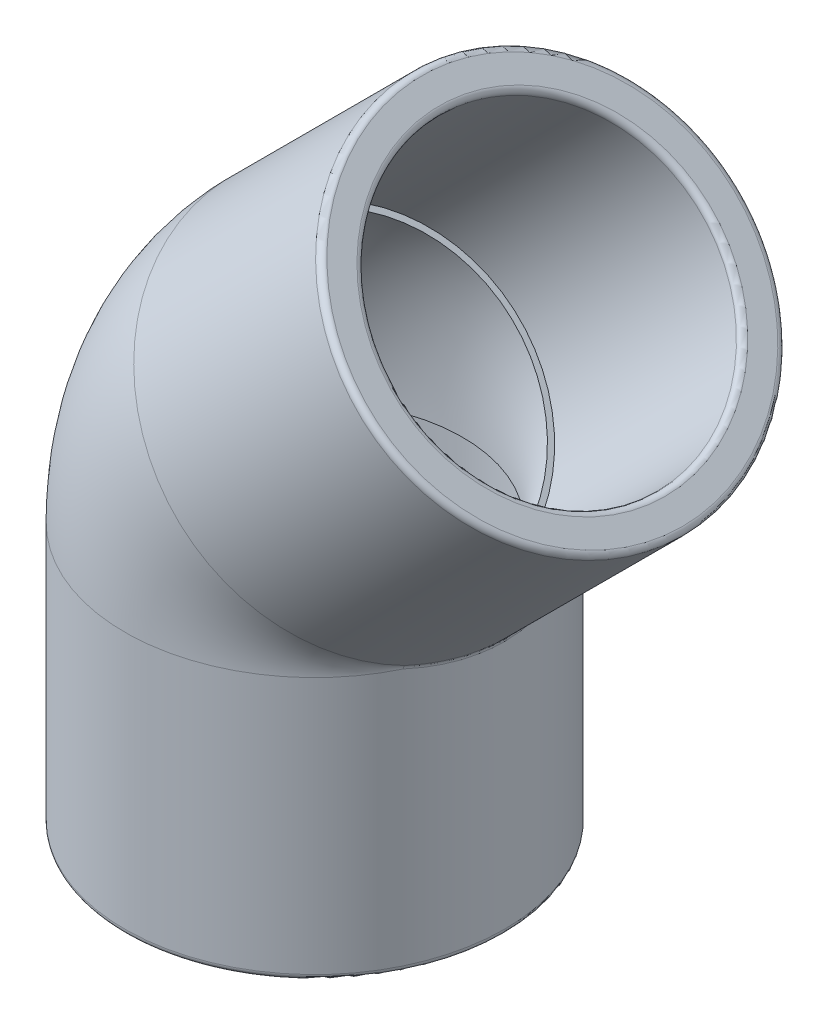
ISO-10303-21;
HEADER;
FILE_DESCRIPTION(('STEP AP214'),'2;1');
FILE_NAME('part.step','',(''),(''),'','','');
FILE_SCHEMA(('AUTOMOTIVE_DESIGN { 1 0 10303 214 1 1 1 1 }'));
ENDSEC;
DATA;
#1=APPLICATION_CONTEXT('core data for automotive mechanical design processes');
#2=APPLICATION_PROTOCOL_DEFINITION('international standard','automotive_design',2000,#1);
#3=PRODUCT_CONTEXT('',#1,'mechanical');
#4=PRODUCT('Part','Part','',(#3));
#5=PRODUCT_RELATED_PRODUCT_CATEGORY('part','',(#4));
#6=PRODUCT_DEFINITION_FORMATION('','',#4);
#7=PRODUCT_DEFINITION_CONTEXT('part definition',#1,'design');
#8=PRODUCT_DEFINITION('design','',#6,#7);
#9=PRODUCT_DEFINITION_SHAPE('','',#8);
#10=(LENGTH_UNIT() NAMED_UNIT(*) SI_UNIT(.MILLI.,.METRE.));
#11=(NAMED_UNIT(*) PLANE_ANGLE_UNIT() SI_UNIT($,.RADIAN.));
#12=(NAMED_UNIT(*) SI_UNIT($,.STERADIAN.) SOLID_ANGLE_UNIT());
#13=UNCERTAINTY_MEASURE_WITH_UNIT(LENGTH_MEASURE(1.E-05),#10,'distance_accuracy_value','');
#14=(GEOMETRIC_REPRESENTATION_CONTEXT(3) GLOBAL_UNCERTAINTY_ASSIGNED_CONTEXT((#13)) GLOBAL_UNIT_ASSIGNED_CONTEXT((#10,
#11,#12)) REPRESENTATION_CONTEXT('',''));
#15=CARTESIAN_POINT('',(0.,0.,0.));
#16=DIRECTION('',(0.,0.,1.));
#17=DIRECTION('',(1.,0.,0.));
#18=AXIS2_PLACEMENT_3D('',#15,#16,#17);
#19=CARTESIAN_POINT('',(0.,-7.9375,0.));
#20=DIRECTION('',(0.,-1.,0.));
#21=DIRECTION('',(1.,0.,0.));
#22=AXIS2_PLACEMENT_3D('',#19,#20,#21);
#23=CYLINDRICAL_SURFACE('',#22,20.6375);
#24=CARTESIAN_POINT('',(0.,-35.8775,0.));
#25=DIRECTION('',(0.,-1.,0.));
#26=DIRECTION('',(1.,0.,0.));
#27=AXIS2_PLACEMENT_3D('',#24,#25,#26);
#28=CIRCLE('',#27,20.6375);
#29=CARTESIAN_POINT('',(20.6375,-35.8775,0.));
#30=VERTEX_POINT('',#29);
#31=EDGE_CURVE('E86',#30,#30,#28,.F.);
#32=ORIENTED_EDGE('',*,*,#31,.T.);
#33=EDGE_LOOP('',(#32));
#34=FACE_BOUND('',#33,.T.);
#35=CARTESIAN_POINT('',(0.,-7.9375,0.));
#36=DIRECTION('',(0.,-1.,0.));
#37=DIRECTION('',(1.,0.,0.));
#38=AXIS2_PLACEMENT_3D('',#35,#36,#37);
#39=CIRCLE('',#38,20.6375);
#40=CARTESIAN_POINT('',(18.590795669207,-7.93749999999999,8.96039745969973));
#41=VERTEX_POINT('',#40);
#42=CARTESIAN_POINT('',(18.5907956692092,-7.93749999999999,-8.96039745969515));
#43=VERTEX_POINT('',#42);
#44=EDGE_CURVE('E84',#41,#43,#39,.T.);
#45=ORIENTED_EDGE('',*,*,#44,.T.);
#46=CARTESIAN_POINT('',(0.,0.,0.));
#47=DIRECTION('',(0.392665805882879,0.919681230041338,0.));
#48=DIRECTION('',(0.919681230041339,-0.392665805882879,0.));
#49=AXIS2_PLACEMENT_3D('',#46,#47,#48);
#50=ELLIPSE('',#49,22.4398403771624,20.6375);
#51=EDGE_CURVE('E77',#43,#41,#50,.F.);
#52=ORIENTED_EDGE('',*,*,#51,.T.);
#53=EDGE_LOOP('',(#45,#52));
#54=FACE_BOUND('',#53,.T.);
#55=ADVANCED_FACE('F44',(#34,#54),#23,.T.);
#56=CARTESIAN_POINT('',(0.,-36.5125,0.));
#57=DIRECTION('',(0.,-1.,0.));
#58=DIRECTION('',(1.,0.,0.));
#59=AXIS2_PLACEMENT_3D('',#56,#57,#58);
#60=PLANE('',#59);
#61=CARTESIAN_POINT('',(0.,-36.5125,0.));
#62=DIRECTION('',(0.,-1.,0.));
#63=DIRECTION('',(1.,0.,0.));
#64=AXIS2_PLACEMENT_3D('',#61,#62,#63);
#65=CIRCLE('',#64,17.3355);
#66=CARTESIAN_POINT('',(17.3355,-36.5125,0.));
#67=VERTEX_POINT('',#66);
#68=EDGE_CURVE('E155',#67,#67,#65,.F.);
#69=ORIENTED_EDGE('',*,*,#68,.T.);
#70=EDGE_LOOP('',(#69));
#71=FACE_BOUND('',#70,.T.);
#72=CARTESIAN_POINT('',(0.,-36.5125,0.));
#73=DIRECTION('',(0.,-1.,0.));
#74=DIRECTION('',(1.,0.,0.));
#75=AXIS2_PLACEMENT_3D('',#72,#73,#74);
#76=CIRCLE('',#75,20.0025);
#77=CARTESIAN_POINT('',(20.0025,-36.5125,0.));
#78=VERTEX_POINT('',#77);
#79=EDGE_CURVE('E152',#78,#78,#76,.T.);
#80=ORIENTED_EDGE('',*,*,#79,.T.);
#81=EDGE_LOOP('',(#80));
#82=FACE_BOUND('',#81,.T.);
#83=ADVANCED_FACE('F129',(#71,#82),#60,.T.);
#84=CARTESIAN_POINT('',(25.8182363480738,25.8182363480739,0.));
#85=DIRECTION('',(-0.707106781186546,-0.707106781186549,0.));
#86=DIRECTION('',(0.707106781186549,-0.707106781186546,0.));
#87=AXIS2_PLACEMENT_3D('',#84,#85,#86);
#88=PLANE('',#87);
#89=CARTESIAN_POINT('',(25.8182363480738,25.8182363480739,0.));
#90=DIRECTION('',(-0.707106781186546,-0.707106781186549,0.));
#91=DIRECTION('',(0.707106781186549,-0.707106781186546,0.));
#92=AXIS2_PLACEMENT_3D('',#89,#90,#91);
#93=CIRCLE('',#92,17.3355);
#94=CARTESIAN_POINT('',(38.0762859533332,13.5601867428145,0.));
#95=VERTEX_POINT('',#94);
#96=EDGE_CURVE('E54',#95,#95,#93,.T.);
#97=ORIENTED_EDGE('',*,*,#96,.T.);
#98=EDGE_LOOP('',(#97));
#99=FACE_BOUND('',#98,.T.);
#100=CARTESIAN_POINT('',(25.8182363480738,25.8182363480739,0.));
#101=DIRECTION('',(-0.707106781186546,-0.707106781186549,0.));
#102=DIRECTION('',(0.707106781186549,-0.707106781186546,0.));
#103=AXIS2_PLACEMENT_3D('',#100,#101,#102);
#104=CIRCLE('',#103,20.0025);
#105=CARTESIAN_POINT('',(39.9621397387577,11.67433295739,0.));
#106=VERTEX_POINT('',#105);
#107=EDGE_CURVE('E161',#106,#106,#104,.F.);
#108=ORIENTED_EDGE('',*,*,#107,.T.);
#109=EDGE_LOOP('',(#108));
#110=FACE_BOUND('',#109,.T.);
#111=ADVANCED_FACE('F125',(#99,#110),#88,.F.);
#112=CARTESIAN_POINT('',(5.61266007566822,5.61266007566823,0.));
#113=DIRECTION('',(0.707106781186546,0.707106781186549,0.));
#114=DIRECTION('',(-0.707106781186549,0.707106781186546,0.));
#115=AXIS2_PLACEMENT_3D('',#112,#113,#114);
#116=CYLINDRICAL_SURFACE('',#115,20.6375);
#117=CARTESIAN_POINT('',(25.3692235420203,25.3692235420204,0.));
#118=DIRECTION('',(-0.707106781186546,-0.707106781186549,0.));
#119=DIRECTION('',(0.707106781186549,-0.707106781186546,0.));
#120=AXIS2_PLACEMENT_3D('',#117,#118,#119);
#121=CIRCLE('',#120,20.6375);
#122=CARTESIAN_POINT('',(39.9621397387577,10.7763073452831,0.));
#123=VERTEX_POINT('',#122);
#124=EDGE_CURVE('E79',#123,#123,#121,.T.);
#125=ORIENTED_EDGE('',*,*,#124,.T.);
#126=EDGE_LOOP('',(#125));
#127=FACE_BOUND('',#126,.T.);
#128=CARTESIAN_POINT('',(5.61266007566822,5.61266007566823,0.));
#129=DIRECTION('',(-0.707106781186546,-0.707106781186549,0.));
#130=DIRECTION('',(0.707106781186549,-0.707106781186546,0.));
#131=AXIS2_PLACEMENT_3D('',#128,#129,#130);
#132=CIRCLE('',#131,20.6375);
#133=CARTESIAN_POINT('',(18.758337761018,-7.53301760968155,8.96039745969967));
#134=VERTEX_POINT('',#133);
#135=CARTESIAN_POINT('',(18.758337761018,-7.53301760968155,-8.96039745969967));
#136=VERTEX_POINT('',#135);
#137=EDGE_CURVE('E90',#134,#136,#132,.T.);
#138=ORIENTED_EDGE('',*,*,#137,.F.);
#139=CARTESIAN_POINT('',(0.,0.,0.));
#140=DIRECTION('',(0.372656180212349,0.92796948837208,0.));
#141=DIRECTION('',(0.927969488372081,-0.372656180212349,0.));
#142=AXIS2_PLACEMENT_3D('',#139,#140,#141);
#143=ELLIPSE('',#142,22.4398403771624,20.6375);
#144=EDGE_CURVE('E60',#134,#136,#143,.T.);
#145=ORIENTED_EDGE('',*,*,#144,.T.);
#146=EDGE_LOOP('',(#138,#145));
#147=FACE_BOUND('',#146,.T.);
#148=ADVANCED_FACE('F128',(#127,#147),#116,.T.);
#149=CARTESIAN_POINT('',(19.1628201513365,-7.93749999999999,0.));
#150=DIRECTION('',(0.,0.,1.));
#151=DIRECTION('',(1.,0.,0.));
#152=AXIS2_PLACEMENT_3D('',#149,#150,#151);
#153=TOROIDAL_SURFACE('',#152,19.1628201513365,16.0655);
#154=CARTESIAN_POINT('',(5.6126600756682,5.61266007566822,0.));
#155=DIRECTION('',(-0.707106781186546,-0.707106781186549,0.));
#156=DIRECTION('',(0.707106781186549,-0.707106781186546,0.));
#157=AXIS2_PLACEMENT_3D('',#154,#155,#156);
#158=CIRCLE('',#157,16.0655);
#159=CARTESIAN_POINT('',(-5.7473639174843,16.9726840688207,0.));
#160=VERTEX_POINT('',#159);
#161=EDGE_CURVE('E200',#160,#160,#158,.T.);
#162=CARTESIAN_POINT('',(0.,-7.9375,0.));
#163=DIRECTION('',(0.,-1.,0.));
#164=DIRECTION('',(1.,0.,0.));
#165=AXIS2_PLACEMENT_3D('',#162,#163,#164);
#166=CIRCLE('',#165,16.0655);
#167=CARTESIAN_POINT('',(-16.0655,-7.9375,0.));
#168=VERTEX_POINT('',#167);
#169=EDGE_CURVE('E96',#168,#168,#166,.T.);
#170=CARTESIAN_POINT('',(19.1628201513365,-7.93749999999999,0.));
#171=DIRECTION('',(0.,0.,1.));
#172=DIRECTION('',(1.,0.,0.));
#173=AXIS2_PLACEMENT_3D('',#170,#171,#172);
#174=CIRCLE('',#173,35.2283201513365);
#175=EDGE_CURVE('',#160,#168,#174,.T.);
#176=ORIENTED_EDGE('',*,*,#161,.F.);
#177=ORIENTED_EDGE('',*,*,#169,.T.);
#178=ORIENTED_EDGE('',*,*,#175,.T.);
#179=ORIENTED_EDGE('',*,*,#175,.F.);
#180=EDGE_LOOP('',(#176,#178,#177,#179));
#181=FACE_BOUND('',#180,.T.);
#182=ADVANCED_FACE('F123',(#181),#153,.F.);
#183=CARTESIAN_POINT('',(19.1628201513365,-7.93749999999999,0.));
#184=DIRECTION('',(0.,0.,1.));
#185=DIRECTION('',(1.,0.,0.));
#186=AXIS2_PLACEMENT_3D('',#183,#184,#185);
#187=DEGENERATE_TOROIDAL_SURFACE('',#186,19.1628201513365,20.6375,.T.);
#188=ORIENTED_EDGE('',*,*,#44,.F.);
#189=CARTESIAN_POINT('',(0.,0.,-20.6375));
#190=CARTESIAN_POINT('',(0.,0.,-20.6375));
#191=CARTESIAN_POINT('',(0.,0.,-20.6375));
#192=CARTESIAN_POINT('',(0.450120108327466,-0.192182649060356,-20.6374911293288));
#193=CARTESIAN_POINT('',(0.452148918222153,-0.18728621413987,-20.6375071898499));
#194=CARTESIAN_POINT('',(0.454176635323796,-0.182389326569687,-20.6374911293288));
#195=CARTESIAN_POINT('',(0.900128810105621,-0.384317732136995,-20.6227698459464));
#196=CARTESIAN_POINT('',(0.904278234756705,-0.374564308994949,-20.6226336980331));
#197=CARTESIAN_POINT('',(0.908240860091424,-0.364733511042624,-20.6227698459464));
#198=CARTESIAN_POINT('',(1.79851451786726,-0.767891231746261,-20.5639142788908));
#199=CARTESIAN_POINT('',(1.80666912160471,-0.748346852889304,-20.5632441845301));
#200=CARTESIAN_POINT('',(1.8147229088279,-0.728760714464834,-20.5639142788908));
#201=CARTESIAN_POINT('',(2.24689147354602,-0.959329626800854,-20.5197790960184));
#202=CARTESIAN_POINT('',(2.25711714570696,-0.934928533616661,-20.5187025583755));
#203=CARTESIAN_POINT('',(2.26714068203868,-0.910443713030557,-20.5197790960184));
#204=CARTESIAN_POINT('',(3.58478352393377,-1.53055413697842,-20.3436189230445));
#205=CARTESIAN_POINT('',(3.60131790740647,-1.4917147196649,-20.3409036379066));
#206=CARTESIAN_POINT('',(3.6170899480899,-1.4525595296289,-20.3436189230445));
#207=CARTESIAN_POINT('',(4.46973235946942,-1.90839064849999,-20.1678385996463));
#208=CARTESIAN_POINT('',(4.49058419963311,-1.86006087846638,-20.1633080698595));
#209=CARTESIAN_POINT('',(4.5100140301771,-1.81114209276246,-20.1678385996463));
#210=CARTESIAN_POINT('',(6.20882486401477,-2.65091114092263,-19.7018749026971));
#211=CARTESIAN_POINT('',(6.23612990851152,-2.58308958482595,-19.69350356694));
#212=CARTESIAN_POINT('',(6.26477940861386,-2.51582492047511,-19.7018749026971));
#213=CARTESIAN_POINT('',(7.06309639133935,-3.01564971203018,-19.4122467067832));
#214=CARTESIAN_POINT('',(7.09377702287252,-2.93833865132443,-19.4011242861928));
#215=CARTESIAN_POINT('',(7.12674971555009,-2.86197699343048,-19.4122467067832));
#216=CARTESIAN_POINT('',(8.72641589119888,-3.7258182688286,-18.7232612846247));
#217=CARTESIAN_POINT('',(8.76165135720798,-3.62919482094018,-18.7070839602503));
#218=CARTESIAN_POINT('',(8.8050592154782,-3.53595648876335,-18.7232612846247));
#219=CARTESIAN_POINT('',(9.53573475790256,-4.07136391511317,-18.3246733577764));
#220=CARTESIAN_POINT('',(9.57306525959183,-3.96529346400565,-18.3052244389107));
#221=CARTESIAN_POINT('',(9.62167174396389,-3.86389367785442,-18.3246733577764));
#222=CARTESIAN_POINT('',(11.0950643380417,-4.73713308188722,-17.4243939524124));
#223=CARTESIAN_POINT('',(11.1346037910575,-4.61210390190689,-17.3994679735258));
#224=CARTESIAN_POINT('',(11.1950541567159,-4.49573630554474,-17.4243939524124));
#225=CARTESIAN_POINT('',(11.845523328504,-5.05754799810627,-16.9236140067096));
#226=CARTESIAN_POINT('',(11.8856805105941,-4.92321006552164,-16.895410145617));
#227=CARTESIAN_POINT('',(11.952276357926,-4.79982338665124,-16.9236140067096));
#228=CARTESIAN_POINT('',(13.274130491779,-5.66750410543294,-15.8273966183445));
#229=CARTESIAN_POINT('',(13.3139872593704,-5.51483409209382,-15.794212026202));
#230=CARTESIAN_POINT('',(13.3937582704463,-5.3786970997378,-15.8273966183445));
#231=CARTESIAN_POINT('',(13.9529104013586,-5.95731502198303,-15.2329261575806));
#232=CARTESIAN_POINT('',(13.9918998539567,-5.79563468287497,-15.1970297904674));
#233=CARTESIAN_POINT('',(14.0786554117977,-5.65373971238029,-15.2329261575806));
#234=CARTESIAN_POINT('',(15.226355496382,-6.50102335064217,-13.9594727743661));
#235=CARTESIAN_POINT('',(15.2627120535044,-6.32202233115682,-13.920033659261));
#236=CARTESIAN_POINT('',(15.36357692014,-6.16974152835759,-13.9594727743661));
#237=CARTESIAN_POINT('',(15.8218122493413,-6.75525872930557,-13.2814195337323));
#238=CARTESIAN_POINT('',(15.856017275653,-6.56777740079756,-13.2403847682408));
#239=CARTESIAN_POINT('',(15.9643999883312,-6.41102147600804,-13.2814195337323));
#240=CARTESIAN_POINT('',(16.918272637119,-7.22340191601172,-11.8524729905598));
#241=CARTESIAN_POINT('',(16.9480366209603,-7.02010662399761,-11.8101535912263));
#242=CARTESIAN_POINT('',(17.0707417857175,-6.85530882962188,-11.8524729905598));
#243=CARTESIAN_POINT('',(17.4201708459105,-7.4376916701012,-11.1023859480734));
#244=CARTESIAN_POINT('',(17.4469042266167,-7.2267443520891,-11.0600242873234));
#245=CARTESIAN_POINT('',(17.5771631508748,-7.05867871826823,-11.1023859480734));
#246=CARTESIAN_POINT('',(18.3208416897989,-7.82224082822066,-9.54236449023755));
#247=CARTESIAN_POINT('',(18.3421525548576,-7.5975683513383,-9.5015231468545));
#248=CARTESIAN_POINT('',(18.4859509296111,-7.4236318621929,-9.54236449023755));
#249=CARTESIAN_POINT('',(18.7205255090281,-7.99288927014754,-8.73304801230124));
#250=CARTESIAN_POINT('',(18.7384922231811,-7.76173761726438,-8.69394876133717));
#251=CARTESIAN_POINT('',(18.889236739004,-7.58558433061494,-8.73304801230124));
#252=CARTESIAN_POINT('',(19.4099410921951,-8.28724117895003,-7.06863519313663));
#253=CARTESIAN_POINT('',(19.422520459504,-8.04507138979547,-7.03400054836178));
#254=CARTESIAN_POINT('',(19.5848654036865,-7.86493653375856,-7.06863519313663));
#255=CARTESIAN_POINT('',(19.7004947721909,-8.41129556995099,-6.21393877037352));
#256=CARTESIAN_POINT('',(19.7100565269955,-8.16417272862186,-6.18278258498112));
#257=CARTESIAN_POINT('',(19.878037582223,-7.98266931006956,-6.21393877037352));
#258=CARTESIAN_POINT('',(20.1668039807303,-8.61039029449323,-4.47363069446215));
#259=CARTESIAN_POINT('',(20.1720480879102,-8.35553589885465,-4.4495388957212));
#260=CARTESIAN_POINT('',(20.3485492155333,-8.17161848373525,-4.47363069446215));
#261=CARTESIAN_POINT('',(20.3431839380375,-8.68569723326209,-3.58821559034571));
#262=CARTESIAN_POINT('',(20.3463324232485,-8.42772683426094,-3.56898608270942));
#263=CARTESIAN_POINT('',(20.5265187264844,-8.24308790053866,-3.58821559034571));
#264=CARTESIAN_POINT('',(20.5783631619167,-8.78610902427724,-1.80183218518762));
#265=CARTESIAN_POINT('',(20.5791129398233,-8.52414768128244,-1.79145589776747));
#266=CARTESIAN_POINT('',(20.7638174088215,-8.33838286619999,-1.80183218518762));
#267=CARTESIAN_POINT('',(20.6375,-8.81135800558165,-0.900916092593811));
#268=CARTESIAN_POINT('',(20.6375,-8.54833239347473,-0.896170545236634));
#269=CARTESIAN_POINT('',(20.8234871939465,-8.36234519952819,-0.900916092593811));
#270=CARTESIAN_POINT('',(20.6375,-8.81135800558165,0.900916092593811));
#271=CARTESIAN_POINT('',(20.6375,-8.54833239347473,0.896170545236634));
#272=CARTESIAN_POINT('',(20.8234871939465,-8.36234519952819,0.900916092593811));
#273=CARTESIAN_POINT('',(20.5783631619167,-8.78610902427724,1.80183218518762));
#274=CARTESIAN_POINT('',(20.5791129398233,-8.52414768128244,1.79145589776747));
#275=CARTESIAN_POINT('',(20.7638174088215,-8.33838286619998,1.80183218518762));
#276=CARTESIAN_POINT('',(20.3431839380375,-8.68569723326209,3.58821559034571));
#277=CARTESIAN_POINT('',(20.3463324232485,-8.42772683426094,3.56898608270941));
#278=CARTESIAN_POINT('',(20.5265187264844,-8.24308790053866,3.58821559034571));
#279=CARTESIAN_POINT('',(20.1668039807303,-8.61039029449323,4.47363069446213));
#280=CARTESIAN_POINT('',(20.1720480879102,-8.35553589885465,4.44953889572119));
#281=CARTESIAN_POINT('',(20.3485492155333,-8.17161848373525,4.47363069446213));
#282=CARTESIAN_POINT('',(19.7004947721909,-8.41129556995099,6.21393877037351));
#283=CARTESIAN_POINT('',(19.7100565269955,-8.16417272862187,6.18278258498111));
#284=CARTESIAN_POINT('',(19.878037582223,-7.98266931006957,6.21393877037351));
#285=CARTESIAN_POINT('',(19.4099410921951,-8.28724117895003,7.06863519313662));
#286=CARTESIAN_POINT('',(19.422520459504,-8.04507138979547,7.03400054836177));
#287=CARTESIAN_POINT('',(19.5848654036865,-7.86493653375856,7.06863519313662));
#288=CARTESIAN_POINT('',(18.7205255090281,-7.99288927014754,8.73304801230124));
#289=CARTESIAN_POINT('',(18.7384922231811,-7.76173761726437,8.69394876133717));
#290=CARTESIAN_POINT('',(18.889236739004,-7.58558433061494,8.73304801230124));
#291=CARTESIAN_POINT('',(18.3208416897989,-7.82224082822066,9.54236449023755));
#292=CARTESIAN_POINT('',(18.3421525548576,-7.5975683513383,9.5015231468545));
#293=CARTESIAN_POINT('',(18.4859509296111,-7.4236318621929,9.54236449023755));
#294=CARTESIAN_POINT('',(17.4201708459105,-7.4376916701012,11.1023859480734));
#295=CARTESIAN_POINT('',(17.4469042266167,-7.22674435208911,11.0600242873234));
#296=CARTESIAN_POINT('',(17.5771631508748,-7.05867871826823,11.1023859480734));
#297=CARTESIAN_POINT('',(16.918272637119,-7.22340191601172,11.8524729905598));
#298=CARTESIAN_POINT('',(16.9480366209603,-7.02010662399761,11.8101535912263));
#299=CARTESIAN_POINT('',(17.0707417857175,-6.85530882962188,11.8524729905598));
#300=CARTESIAN_POINT('',(15.8218122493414,-6.75525872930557,13.2814195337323));
#301=CARTESIAN_POINT('',(15.856017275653,-6.56777740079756,13.2403847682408));
#302=CARTESIAN_POINT('',(15.9643999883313,-6.41102147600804,13.2814195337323));
#303=CARTESIAN_POINT('',(15.226355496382,-6.50102335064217,13.9594727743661));
#304=CARTESIAN_POINT('',(15.2627120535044,-6.32202233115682,13.920033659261));
#305=CARTESIAN_POINT('',(15.36357692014,-6.1697415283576,13.9594727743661));
#306=CARTESIAN_POINT('',(13.9529104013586,-5.95731502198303,15.2329261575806));
#307=CARTESIAN_POINT('',(13.9918998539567,-5.79563468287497,15.1970297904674));
#308=CARTESIAN_POINT('',(14.0786554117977,-5.65373971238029,15.2329261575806));
#309=CARTESIAN_POINT('',(13.274130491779,-5.66750410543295,15.8273966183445));
#310=CARTESIAN_POINT('',(13.3139872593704,-5.51483409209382,15.794212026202));
#311=CARTESIAN_POINT('',(13.3937582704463,-5.37869709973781,15.8273966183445));
#312=CARTESIAN_POINT('',(11.845523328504,-5.05754799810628,16.9236140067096));
#313=CARTESIAN_POINT('',(11.8856805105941,-4.92321006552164,16.895410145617));
#314=CARTESIAN_POINT('',(11.9522763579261,-4.79982338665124,16.9236140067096));
#315=CARTESIAN_POINT('',(11.0950643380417,-4.73713308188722,17.4243939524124));
#316=CARTESIAN_POINT('',(11.1346037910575,-4.61210390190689,17.3994679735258));
#317=CARTESIAN_POINT('',(11.1950541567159,-4.49573630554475,17.4243939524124));
#318=CARTESIAN_POINT('',(9.53573475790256,-4.07136391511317,18.3246733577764));
#319=CARTESIAN_POINT('',(9.57306525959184,-3.96529346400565,18.3052244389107));
#320=CARTESIAN_POINT('',(9.62167174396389,-3.86389367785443,18.3246733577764));
#321=CARTESIAN_POINT('',(8.72641589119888,-3.72581826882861,18.7232612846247));
#322=CARTESIAN_POINT('',(8.76165135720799,-3.62919482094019,18.7070839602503));
#323=CARTESIAN_POINT('',(8.80505921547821,-3.53595648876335,18.7232612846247));
#324=CARTESIAN_POINT('',(7.06309639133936,-3.01564971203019,19.4122467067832));
#325=CARTESIAN_POINT('',(7.09377702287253,-2.93833865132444,19.4011242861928));
#326=CARTESIAN_POINT('',(7.1267497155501,-2.86197699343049,19.4122467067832));
#327=CARTESIAN_POINT('',(6.20882486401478,-2.65091114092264,19.7018749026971));
#328=CARTESIAN_POINT('',(6.23612990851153,-2.58308958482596,19.69350356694));
#329=CARTESIAN_POINT('',(6.26477940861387,-2.51582492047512,19.7018749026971));
#330=CARTESIAN_POINT('',(4.46973235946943,-1.9083906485,20.1678385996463));
#331=CARTESIAN_POINT('',(4.49058419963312,-1.86006087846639,20.1633080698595));
#332=CARTESIAN_POINT('',(4.51001403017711,-1.81114209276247,20.1678385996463));
#333=CARTESIAN_POINT('',(3.58478352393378,-1.53055413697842,20.3436189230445));
#334=CARTESIAN_POINT('',(3.60131790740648,-1.49171471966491,20.3409036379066));
#335=CARTESIAN_POINT('',(3.61708994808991,-1.4525595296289,20.3436189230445));
#336=CARTESIAN_POINT('',(2.24689147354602,-0.959329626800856,20.5197790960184));
#337=CARTESIAN_POINT('',(2.25711714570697,-0.934928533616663,20.5187025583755));
#338=CARTESIAN_POINT('',(2.26714068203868,-0.91044371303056,20.5197790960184));
#339=CARTESIAN_POINT('',(1.79851451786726,-0.767891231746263,20.5639142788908));
#340=CARTESIAN_POINT('',(1.80666912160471,-0.748346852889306,20.5632441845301));
#341=CARTESIAN_POINT('',(1.81472290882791,-0.728760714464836,20.5639142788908));
#342=CARTESIAN_POINT('',(0.900128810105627,-0.384317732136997,20.6227698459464));
#343=CARTESIAN_POINT('',(0.904278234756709,-0.374564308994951,20.6226336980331));
#344=CARTESIAN_POINT('',(0.90824086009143,-0.364733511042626,20.6227698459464));
#345=CARTESIAN_POINT('',(0.450120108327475,-0.192182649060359,20.6374911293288));
#346=CARTESIAN_POINT('',(0.452148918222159,-0.187286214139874,20.6375071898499));
#347=CARTESIAN_POINT('',(0.454176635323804,-0.18238932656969,20.6374911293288));
#348=CARTESIAN_POINT('',(0.,0.,20.6375));
#349=CARTESIAN_POINT('',(0.,0.,20.6375));
#350=CARTESIAN_POINT('',(0.,0.,20.6375));
#351=(BOUNDED_SURFACE() B_SPLINE_SURFACE(3,2,((#189,#190,#191),(#192,#193,#194),(#195,#196,
#197),(#198,#199,#200),(#201,#202,#203),(#204,#205,#206),(#207,#208,#209),(#210,#211,#212),
(#213,#214,#215),(#216,#217,#218),(#219,#220,#221),(#222,#223,#224),(#225,#226,#227),(#228,#229,
#230),(#231,#232,#233),(#234,#235,#236),(#237,#238,#239),(#240,#241,#242),(#243,#244,#245),
(#246,#247,#248),(#249,#250,#251),(#252,#253,#254),(#255,#256,#257),(#258,#259,#260),(#261,#262,
#263),(#264,#265,#266),(#267,#268,#269),(#270,#271,#272),(#273,#274,#275),(#276,#277,#278),
(#279,#280,#281),(#282,#283,#284),(#285,#286,#287),(#288,#289,#290),(#291,#292,#293),(#294,#295,
#296),(#297,#298,#299),(#300,#301,#302),(#303,#304,#305),(#306,#307,#308),(#309,#310,#311),
(#312,#313,#314),(#315,#316,#317),(#318,#319,#320),(#321,#322,#323),(#324,#325,#326),(#327,#328,
#329),(#330,#331,#332),(#333,#334,#335),(#336,#337,#338),(#339,#340,#341),(#342,#343,#344),
(#345,#346,#347),(#348,#349,#350)),.UNSPECIFIED.,.F.,.F.,.F.) B_SPLINE_SURFACE_WITH_KNOTS((4,2,
2,2,2,2,2,2,2,2,2,2,2,2,2,2,2,2,2,2,2,2,2,2,2,2,4),(3,3),(0.,1.50611382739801,3.01227369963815,
6.01570699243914,9.00467224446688,11.973056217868,14.9160372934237,17.8304239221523,
20.7149087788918,23.570213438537,26.399099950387,29.2062317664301,31.9978783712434,
34.781475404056,37.5650724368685,40.3567190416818,43.163850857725,45.992737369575,
48.8480420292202,51.7325268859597,54.6469135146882,57.589894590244,60.5582785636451,
63.5472438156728,66.5506771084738,68.056836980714,69.562950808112),(0.,1.),
.UNSPECIFIED.) GEOMETRIC_REPRESENTATION_ITEM() RATIONAL_B_SPLINE_SURFACE(((1.,1.,1.),(1.,
1.00000023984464,1.),(1.,0.999895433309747,1.),(1.,0.999478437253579,1.),(1.,0.999166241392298,
1.),(1.,0.997925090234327,1.),(1.,0.996691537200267,1.),(1.,0.993481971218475,1.),(1.,
0.991509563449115,1.),(1.,0.986943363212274,1.),(1.,0.984353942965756,1.),(1.,0.978717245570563,
1.),(1.,0.975674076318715,1.),(1.,0.969328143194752,1.),(1.,0.966028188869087,1.),(1.,
0.959390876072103,1.),(1.,0.95605424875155,1.),(1.,0.949575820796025,1.),(1.,0.94643239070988,
1.),(1.,0.940566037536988,1.),(1.,0.93783949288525,1.),(1.,0.933007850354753,1.),(1.,
0.930898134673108,1.),(1.,0.927458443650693,1.),(1.,0.926124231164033,1.),(1.,0.924336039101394,
1.),(1.,0.923879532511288,1.),(1.,0.923879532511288,1.),(1.,0.924336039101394,1.),(1.,
0.926124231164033,1.),(1.,0.927458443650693,1.),(1.,0.930898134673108,1.),(1.,0.933007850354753,
1.),(1.,0.93783949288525,1.),(1.,0.940566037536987,1.),(1.,0.94643239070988,1.),(1.,
0.949575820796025,1.),(1.,0.956054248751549,1.),(1.,0.959390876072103,1.),(1.,0.966028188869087,
1.),(1.,0.969328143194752,1.),(1.,0.975674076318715,1.),(1.,0.978717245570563,1.),(1.,
0.984353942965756,1.),(1.,0.986943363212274,1.),(1.,0.991509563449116,1.),(1.,0.993481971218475,
1.),(1.,0.996691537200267,1.),(1.,0.997925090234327,1.),(1.,0.999166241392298,1.),(1.,
0.999478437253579,1.),(1.,0.999895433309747,1.),(1.,1.00000023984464,1.),(1.,1.,1.))) REPRESENTATION_ITEM('') SURFACE());
#352=CARTESIAN_POINT('',(18.590795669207,-7.93749999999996,8.96039745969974));
#353=CARTESIAN_POINT('',(18.5909431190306,-7.933575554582,8.9600914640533));
#354=CARTESIAN_POINT('',(18.5911319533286,-7.92965242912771,8.95978345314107));
#355=CARTESIAN_POINT('',(18.5934114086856,-7.890667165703,8.95672079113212));
#356=CARTESIAN_POINT('',(18.5986952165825,-7.85575188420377,8.95396284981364));
#357=CARTESIAN_POINT('',(18.6144047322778,-7.78688516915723,8.95125839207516));
#358=CARTESIAN_POINT('',(18.6248461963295,-7.75293702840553,8.95132054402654));
#359=CARTESIAN_POINT('',(18.6519093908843,-7.68760069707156,8.95132054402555));
#360=CARTESIAN_POINT('',(18.6685311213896,-7.65621250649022,8.95125839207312));
#361=CARTESIAN_POINT('',(18.7061189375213,-7.59640808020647,8.95396284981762));
#362=CARTESIAN_POINT('',(18.7270715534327,-7.56798303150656,8.95672079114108));
#363=CARTESIAN_POINT('',(18.7530264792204,-7.53880446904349,8.95978345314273));
#364=CARTESIAN_POINT('',(18.7556670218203,-7.53589687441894,8.96009146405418));
#365=CARTESIAN_POINT('',(18.758337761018,-7.53301760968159,8.96039745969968));
#366=B_SPLINE_CURVE_WITH_KNOTS('',3,(#352,#353,#354,#355,#356,#357,#358,#359,#360,#361,#362,
#363,#364,#365),.UNSPECIFIED.,.F.,.F.,(4,2,2,2,2,2,4),(0.,0.0118184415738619,0.117499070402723,
0.223504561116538,0.329510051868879,0.435190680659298,0.447009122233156),.UNSPECIFIED.);
#367=EDGE_CURVE('E67',#41,#134,#366,.T.);
#368=ORIENTED_EDGE('',*,*,#367,.T.);
#369=ORIENTED_EDGE('',*,*,#137,.T.);
#370=CARTESIAN_POINT('',(18.758337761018,-7.53301760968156,-8.96039745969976));
#371=CARTESIAN_POINT('',(18.7556647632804,-7.53589542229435,-8.96009701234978));
#372=CARTESIAN_POINT('',(18.7530244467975,-7.53880318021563,-8.95978842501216));
#373=CARTESIAN_POINT('',(18.7308157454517,-7.56380065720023,-8.95712344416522));
#374=CARTESIAN_POINT('',(18.713006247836,-7.5874656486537,-8.95452099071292));
#375=CARTESIAN_POINT('',(18.6883529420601,-7.62440697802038,-8.95259669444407));
#376=CARTESIAN_POINT('',(18.6804737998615,-7.63697083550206,-8.95228564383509));
#377=CARTESIAN_POINT('',(18.6695490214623,-7.65630499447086,-8.95150903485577));
#378=CARTESIAN_POINT('',(18.6660584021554,-7.66282670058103,-8.95119879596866));
#379=CARTESIAN_POINT('',(18.6590112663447,-7.67584998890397,-8.95132122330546));
#380=CARTESIAN_POINT('',(18.6554547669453,-7.68235157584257,-8.95175369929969));
#381=CARTESIAN_POINT('',(18.6498952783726,-7.69419924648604,-8.95136709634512));
#382=CARTESIAN_POINT('',(18.6477230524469,-7.69946873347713,-8.95081209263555));
#383=CARTESIAN_POINT('',(18.6430859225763,-7.70988368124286,-8.95071886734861));
#384=CARTESIAN_POINT('',(18.6406209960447,-7.71502913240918,-8.95118072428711));
#385=CARTESIAN_POINT('',(18.6349095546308,-7.72837006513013,-8.95153672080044));
#386=CARTESIAN_POINT('',(18.6319713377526,-7.73669663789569,-8.95098308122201));
#387=CARTESIAN_POINT('',(18.6261172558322,-7.75334894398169,-8.95068793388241));
#388=CARTESIAN_POINT('',(18.6232014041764,-7.76167467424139,-8.95094687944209));
#389=CARTESIAN_POINT('',(18.6150444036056,-7.78687884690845,-8.95169376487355));
#390=CARTESIAN_POINT('',(18.6104045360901,-7.80395948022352,-8.95215086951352));
#391=CARTESIAN_POINT('',(18.60274668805,-7.83844992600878,-8.95306284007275));
#392=CARTESIAN_POINT('',(18.5997267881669,-7.85585932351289,-8.95351770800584));
#393=CARTESIAN_POINT('',(18.5945776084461,-7.89072065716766,-8.95596988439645));
#394=CARTESIAN_POINT('',(18.5924485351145,-7.90817260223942,-8.95796755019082));
#395=CARTESIAN_POINT('',(18.5911186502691,-7.92964847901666,-8.95981180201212));
#396=CARTESIAN_POINT('',(18.5909279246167,-7.93357110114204,-8.96012382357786));
#397=CARTESIAN_POINT('',(18.590795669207,-7.93749999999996,-8.96039745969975));
#398=B_SPLINE_CURVE_WITH_KNOTS('',3,(#370,#371,#372,#373,#374,#375,#376,#377,#378,#379,#380,
#381,#382,#383,#384,#385,#386,#387,#388,#389,#390,#391,#392,#393,#394,#395,#396,#397),
.UNSPECIFIED.,.F.,.F.,(4,2,2,2,2,2,2,2,2,2,2,2,2,4),(0.,0.011818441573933,0.100618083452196,
0.145081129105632,0.167283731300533,0.189480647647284,0.206591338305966,0.223703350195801,
0.25016041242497,0.276632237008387,0.329656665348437,0.38261813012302,0.435591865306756,
0.447410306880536),.UNSPECIFIED.);
#399=EDGE_CURVE('E80',#136,#43,#398,.T.);
#400=ORIENTED_EDGE('',*,*,#399,.T.);
#401=EDGE_LOOP('',(#188,#368,#369,#400));
#402=FACE_BOUND('',#401,.T.);
#403=ADVANCED_FACE('F88',(#402),#187,.T.);
#404=CARTESIAN_POINT('',(0.,-7.9375,0.));
#405=DIRECTION('',(0.,-1.,0.));
#406=DIRECTION('',(1.,0.,0.));
#407=AXIS2_PLACEMENT_3D('',#404,#405,#406);
#408=CYLINDRICAL_SURFACE('',#407,16.7005);
#409=CARTESIAN_POINT('',(0.,-35.8775,0.));
#410=DIRECTION('',(0.,-1.,0.));
#411=DIRECTION('',(1.,0.,0.));
#412=AXIS2_PLACEMENT_3D('',#409,#410,#411);
#413=CIRCLE('',#412,16.7005);
#414=CARTESIAN_POINT('',(16.7005,-35.8775,0.));
#415=VERTEX_POINT('',#414);
#416=EDGE_CURVE('E156',#415,#415,#413,.T.);
#417=ORIENTED_EDGE('',*,*,#416,.T.);
#418=EDGE_LOOP('',(#417));
#419=FACE_BOUND('',#418,.T.);
#420=CARTESIAN_POINT('',(0.,-7.9375,0.));
#421=DIRECTION('',(0.,-1.,0.));
#422=DIRECTION('',(1.,0.,0.));
#423=AXIS2_PLACEMENT_3D('',#420,#421,#422);
#424=CIRCLE('',#423,16.7005);
#425=CARTESIAN_POINT('',(16.7005,-7.93749999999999,0.));
#426=VERTEX_POINT('',#425);
#427=EDGE_CURVE('E197',#426,#426,#424,.T.);
#428=ORIENTED_EDGE('',*,*,#427,.F.);
#429=EDGE_LOOP('',(#428));
#430=FACE_BOUND('',#429,.T.);
#431=ADVANCED_FACE('F122',(#419,#430),#408,.F.);
#432=CARTESIAN_POINT('',(0.,-7.9375,0.));
#433=DIRECTION('',(0.,-1.,0.));
#434=DIRECTION('',(1.,0.,0.));
#435=AXIS2_PLACEMENT_3D('',#432,#433,#434);
#436=PLANE('',#435);
#437=ORIENTED_EDGE('',*,*,#169,.F.);
#438=EDGE_LOOP('',(#437));
#439=FACE_BOUND('',#438,.T.);
#440=ORIENTED_EDGE('',*,*,#427,.T.);
#441=EDGE_LOOP('',(#440));
#442=FACE_BOUND('',#441,.T.);
#443=ADVANCED_FACE('F194',(#439,#442),#436,.T.);
#444=CARTESIAN_POINT('',(5.61266007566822,5.61266007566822,0.));
#445=DIRECTION('',(0.707106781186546,0.707106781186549,0.));
#446=DIRECTION('',(-0.707106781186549,0.707106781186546,0.));
#447=AXIS2_PLACEMENT_3D('',#444,#445,#446);
#448=CYLINDRICAL_SURFACE('',#447,16.7005);
#449=CARTESIAN_POINT('',(25.3692235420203,25.3692235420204,0.));
#450=DIRECTION('',(-0.707106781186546,-0.707106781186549,0.));
#451=DIRECTION('',(0.707106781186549,-0.707106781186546,0.));
#452=AXIS2_PLACEMENT_3D('',#449,#450,#451);
#453=CIRCLE('',#452,16.7005);
#454=CARTESIAN_POINT('',(37.1782603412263,13.5601867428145,0.));
#455=VERTEX_POINT('',#454);
#456=EDGE_CURVE('E11',#455,#455,#453,.F.);
#457=ORIENTED_EDGE('',*,*,#456,.T.);
#458=EDGE_LOOP('',(#457));
#459=FACE_BOUND('',#458,.T.);
#460=CARTESIAN_POINT('',(5.61266007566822,5.61266007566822,0.));
#461=DIRECTION('',(-0.707106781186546,-0.707106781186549,0.));
#462=DIRECTION('',(0.707106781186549,-0.707106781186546,0.));
#463=AXIS2_PLACEMENT_3D('',#460,#461,#462);
#464=CIRCLE('',#463,16.7005);
#465=CARTESIAN_POINT('',(17.4216968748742,-6.1963767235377,0.));
#466=VERTEX_POINT('',#465);
#467=EDGE_CURVE('E206',#466,#466,#464,.T.);
#468=ORIENTED_EDGE('',*,*,#467,.T.);
#469=EDGE_LOOP('',(#468));
#470=FACE_BOUND('',#469,.T.);
#471=ADVANCED_FACE('F213',(#459,#470),#448,.F.);
#472=CARTESIAN_POINT('',(5.61266007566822,5.61266007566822,0.));
#473=DIRECTION('',(-0.707106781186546,-0.707106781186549,0.));
#474=DIRECTION('',(0.707106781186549,-0.707106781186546,0.));
#475=AXIS2_PLACEMENT_3D('',#472,#473,#474);
#476=PLANE('',#475);
#477=ORIENTED_EDGE('',*,*,#161,.T.);
#478=EDGE_LOOP('',(#477));
#479=FACE_BOUND('',#478,.T.);
#480=ORIENTED_EDGE('',*,*,#467,.F.);
#481=EDGE_LOOP('',(#480));
#482=FACE_BOUND('',#481,.T.);
#483=ADVANCED_FACE('F187',(#479,#482),#476,.F.);
#484=ORIENTED_EDGE('',*,*,#399,.F.);
#485=ORIENTED_EDGE('',*,*,#144,.F.);
#486=ORIENTED_EDGE('',*,*,#367,.F.);
#487=ORIENTED_EDGE('',*,*,#51,.F.);
#488=EDGE_LOOP('',(#484,#485,#486,#487));
#489=FACE_BOUND('',#488,.T.);
#490=ADVANCED_FACE('F76',(#489),#351,.F.);
#491=CARTESIAN_POINT('',(0.,-35.8775,0.));
#492=DIRECTION('',(0.,-1.,0.));
#493=DIRECTION('',(1.,0.,0.));
#494=AXIS2_PLACEMENT_3D('',#491,#492,#493);
#495=TOROIDAL_SURFACE('',#494,17.3355,0.635);
#496=ORIENTED_EDGE('',*,*,#68,.F.);
#497=EDGE_LOOP('',(#496));
#498=FACE_BOUND('',#497,.T.);
#499=ORIENTED_EDGE('',*,*,#416,.F.);
#500=EDGE_LOOP('',(#499));
#501=FACE_BOUND('',#500,.T.);
#502=ADVANCED_FACE('F148',(#498,#501),#495,.T.);
#503=CARTESIAN_POINT('',(0.,-35.8775,0.));
#504=DIRECTION('',(0.,-1.,0.));
#505=DIRECTION('',(1.,0.,0.));
#506=AXIS2_PLACEMENT_3D('',#503,#504,#505);
#507=TOROIDAL_SURFACE('',#506,20.0025,0.635);
#508=ORIENTED_EDGE('',*,*,#31,.F.);
#509=EDGE_LOOP('',(#508));
#510=FACE_BOUND('',#509,.T.);
#511=ORIENTED_EDGE('',*,*,#79,.F.);
#512=EDGE_LOOP('',(#511));
#513=FACE_BOUND('',#512,.T.);
#514=ADVANCED_FACE('F144',(#510,#513),#507,.T.);
#515=CARTESIAN_POINT('',(25.3692235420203,25.3692235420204,0.));
#516=DIRECTION('',(-0.707106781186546,-0.707106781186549,0.));
#517=DIRECTION('',(0.707106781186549,-0.707106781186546,0.));
#518=AXIS2_PLACEMENT_3D('',#515,#516,#517);
#519=TOROIDAL_SURFACE('',#518,17.3355,0.635);
#520=ORIENTED_EDGE('',*,*,#456,.F.);
#521=EDGE_LOOP('',(#520));
#522=FACE_BOUND('',#521,.T.);
#523=ORIENTED_EDGE('',*,*,#96,.F.);
#524=EDGE_LOOP('',(#523));
#525=FACE_BOUND('',#524,.T.);
#526=ADVANCED_FACE('F147',(#522,#525),#519,.T.);
#527=CARTESIAN_POINT('',(25.3692235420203,25.3692235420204,0.));
#528=DIRECTION('',(-0.707106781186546,-0.707106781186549,0.));
#529=DIRECTION('',(0.707106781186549,-0.707106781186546,0.));
#530=AXIS2_PLACEMENT_3D('',#527,#528,#529);
#531=TOROIDAL_SURFACE('',#530,20.0025,0.635);
#532=ORIENTED_EDGE('',*,*,#107,.F.);
#533=EDGE_LOOP('',(#532));
#534=FACE_BOUND('',#533,.T.);
#535=ORIENTED_EDGE('',*,*,#124,.F.);
#536=EDGE_LOOP('',(#535));
#537=FACE_BOUND('',#536,.T.);
#538=ADVANCED_FACE('F46',(#534,#537),#531,.T.);
#539=CLOSED_SHELL('',(#55,#83,#111,#148,#182,#403,#431,#443,#471,#483,#490,#502,#514,#526,#538));
#540=MANIFOLD_SOLID_BREP('B2',#539);
#541=ADVANCED_BREP_SHAPE_REPRESENTATION('',(#18,#540),#14);
#542=SHAPE_DEFINITION_REPRESENTATION(#9,#541);
ENDSEC;
END-ISO-10303-21;
